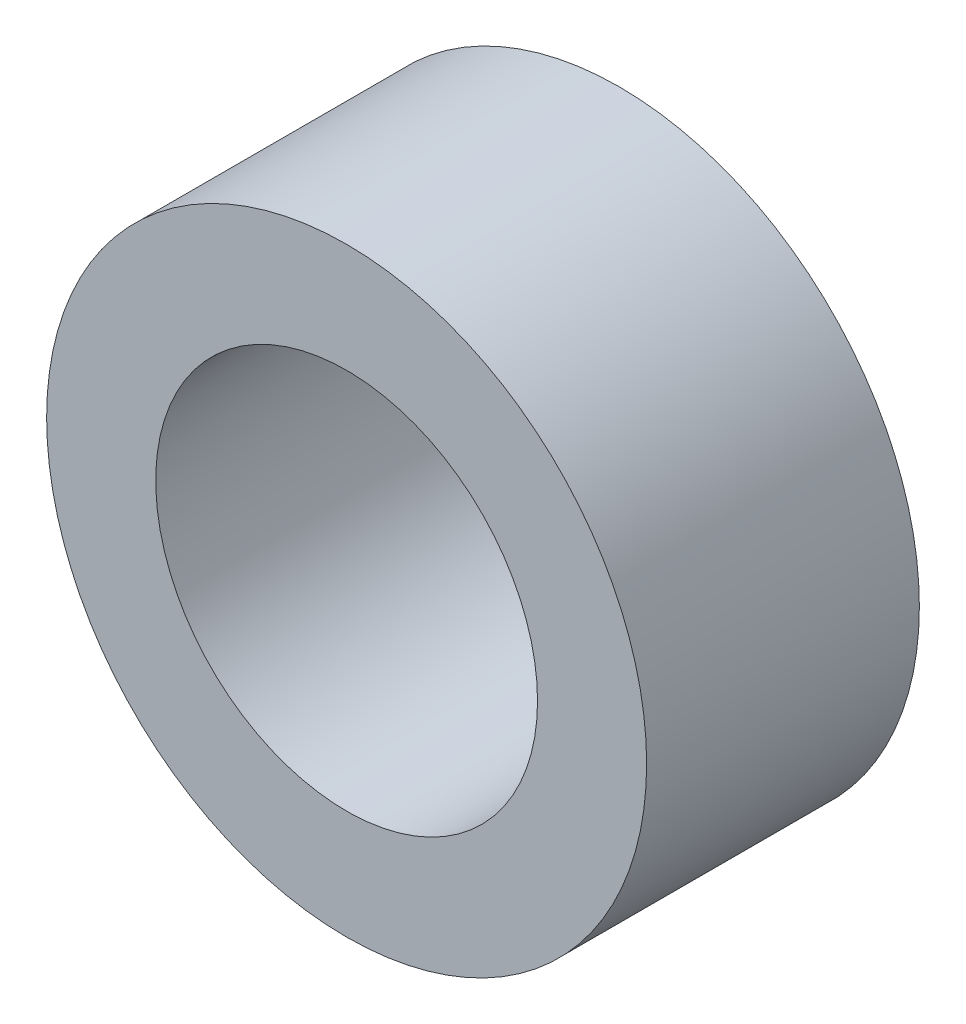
ISO-10303-21;
HEADER;
FILE_DESCRIPTION(('STEP AP214'),'2;1');
FILE_NAME('part.step','',(''),(''),'','','');
FILE_SCHEMA(('AUTOMOTIVE_DESIGN { 1 0 10303 214 1 1 1 1 }'));
ENDSEC;
DATA;
#1=APPLICATION_CONTEXT('core data for automotive mechanical design processes');
#2=APPLICATION_PROTOCOL_DEFINITION('international standard','automotive_design',2000,#1);
#3=PRODUCT_CONTEXT('',#1,'mechanical');
#4=PRODUCT('Part','Part','',(#3));
#5=PRODUCT_RELATED_PRODUCT_CATEGORY('part','',(#4));
#6=PRODUCT_DEFINITION_FORMATION('','',#4);
#7=PRODUCT_DEFINITION_CONTEXT('part definition',#1,'design');
#8=PRODUCT_DEFINITION('design','',#6,#7);
#9=PRODUCT_DEFINITION_SHAPE('','',#8);
#10=(LENGTH_UNIT() NAMED_UNIT(*) SI_UNIT(.MILLI.,.METRE.));
#11=(NAMED_UNIT(*) PLANE_ANGLE_UNIT() SI_UNIT($,.RADIAN.));
#12=(NAMED_UNIT(*) SI_UNIT($,.STERADIAN.) SOLID_ANGLE_UNIT());
#13=UNCERTAINTY_MEASURE_WITH_UNIT(LENGTH_MEASURE(1.E-05),#10,'distance_accuracy_value','');
#14=(GEOMETRIC_REPRESENTATION_CONTEXT(3) GLOBAL_UNCERTAINTY_ASSIGNED_CONTEXT((#13)) GLOBAL_UNIT_ASSIGNED_CONTEXT((#10,
#11,#12)) REPRESENTATION_CONTEXT('',''));
#15=CARTESIAN_POINT('',(0.,0.,0.));
#16=DIRECTION('',(0.,0.,1.));
#17=DIRECTION('',(1.,0.,0.));
#18=AXIS2_PLACEMENT_3D('',#15,#16,#17);
#19=CARTESIAN_POINT('',(0.,0.,2.5));
#20=DIRECTION('',(0.,0.,1.));
#21=DIRECTION('',(1.,0.,0.));
#22=AXIS2_PLACEMENT_3D('',#19,#20,#21);
#23=PLANE('',#22);
#24=CARTESIAN_POINT('',(0.,0.,2.5));
#25=DIRECTION('',(0.,0.,1.));
#26=DIRECTION('',(1.,0.,0.));
#27=AXIS2_PLACEMENT_3D('',#24,#25,#26);
#28=CIRCLE('',#27,2.75);
#29=CARTESIAN_POINT('',(2.75,0.,2.5));
#30=VERTEX_POINT('',#29);
#31=EDGE_CURVE('E10',#30,#30,#28,.T.);
#32=ORIENTED_EDGE('',*,*,#31,.T.);
#33=EDGE_LOOP('',(#32));
#34=FACE_BOUND('',#33,.T.);
#35=CARTESIAN_POINT('',(0.,0.,2.5));
#36=DIRECTION('',(0.,0.,1.));
#37=DIRECTION('',(1.,0.,0.));
#38=AXIS2_PLACEMENT_3D('',#35,#36,#37);
#39=CIRCLE('',#38,1.75);
#40=CARTESIAN_POINT('',(1.75,0.,2.5));
#41=VERTEX_POINT('',#40);
#42=EDGE_CURVE('E44',#41,#41,#39,.T.);
#43=ORIENTED_EDGE('',*,*,#42,.F.);
#44=EDGE_LOOP('',(#43));
#45=FACE_BOUND('',#44,.T.);
#46=ADVANCED_FACE('F33',(#34,#45),#23,.T.);
#47=CARTESIAN_POINT('',(0.,0.,0.));
#48=DIRECTION('',(0.,0.,1.));
#49=DIRECTION('',(1.,0.,0.));
#50=AXIS2_PLACEMENT_3D('',#47,#48,#49);
#51=PLANE('',#50);
#52=CARTESIAN_POINT('',(0.,0.,0.));
#53=DIRECTION('',(0.,0.,1.));
#54=DIRECTION('',(1.,0.,0.));
#55=AXIS2_PLACEMENT_3D('',#52,#53,#54);
#56=CIRCLE('',#55,2.75);
#57=CARTESIAN_POINT('',(2.75,0.,0.));
#58=VERTEX_POINT('',#57);
#59=EDGE_CURVE('E37',#58,#58,#56,.T.);
#60=ORIENTED_EDGE('',*,*,#59,.F.);
#61=EDGE_LOOP('',(#60));
#62=FACE_BOUND('',#61,.T.);
#63=CARTESIAN_POINT('',(0.,0.,0.));
#64=DIRECTION('',(0.,0.,1.));
#65=DIRECTION('',(1.,0.,0.));
#66=AXIS2_PLACEMENT_3D('',#63,#64,#65);
#67=CIRCLE('',#66,1.75);
#68=CARTESIAN_POINT('',(1.75,0.,0.));
#69=VERTEX_POINT('',#68);
#70=EDGE_CURVE('E46',#69,#69,#67,.T.);
#71=ORIENTED_EDGE('',*,*,#70,.T.);
#72=EDGE_LOOP('',(#71));
#73=FACE_BOUND('',#72,.T.);
#74=ADVANCED_FACE('F56',(#62,#73),#51,.F.);
#75=CARTESIAN_POINT('',(0.,0.,2.5));
#76=DIRECTION('',(0.,0.,-1.));
#77=DIRECTION('',(-1.,0.,0.));
#78=AXIS2_PLACEMENT_3D('',#75,#76,#77);
#79=CYLINDRICAL_SURFACE('',#78,2.75);
#80=ORIENTED_EDGE('',*,*,#31,.F.);
#81=EDGE_LOOP('',(#80));
#82=FACE_BOUND('',#81,.T.);
#83=ORIENTED_EDGE('',*,*,#59,.T.);
#84=EDGE_LOOP('',(#83));
#85=FACE_BOUND('',#84,.T.);
#86=ADVANCED_FACE('F35',(#82,#85),#79,.T.);
#87=CARTESIAN_POINT('',(0.,0.,2.5));
#88=DIRECTION('',(0.,0.,-1.));
#89=DIRECTION('',(-1.,0.,0.));
#90=AXIS2_PLACEMENT_3D('',#87,#88,#89);
#91=CYLINDRICAL_SURFACE('',#90,1.75);
#92=ORIENTED_EDGE('',*,*,#42,.T.);
#93=EDGE_LOOP('',(#92));
#94=FACE_BOUND('',#93,.T.);
#95=ORIENTED_EDGE('',*,*,#70,.F.);
#96=EDGE_LOOP('',(#95));
#97=FACE_BOUND('',#96,.T.);
#98=ADVANCED_FACE('F52',(#94,#97),#91,.F.);
#99=CLOSED_SHELL('',(#46,#74,#86,#98));
#100=MANIFOLD_SOLID_BREP('B2',#99);
#101=ADVANCED_BREP_SHAPE_REPRESENTATION('',(#18,#100),#14);
#102=SHAPE_DEFINITION_REPRESENTATION(#9,#101);
ENDSEC;
END-ISO-10303-21;
